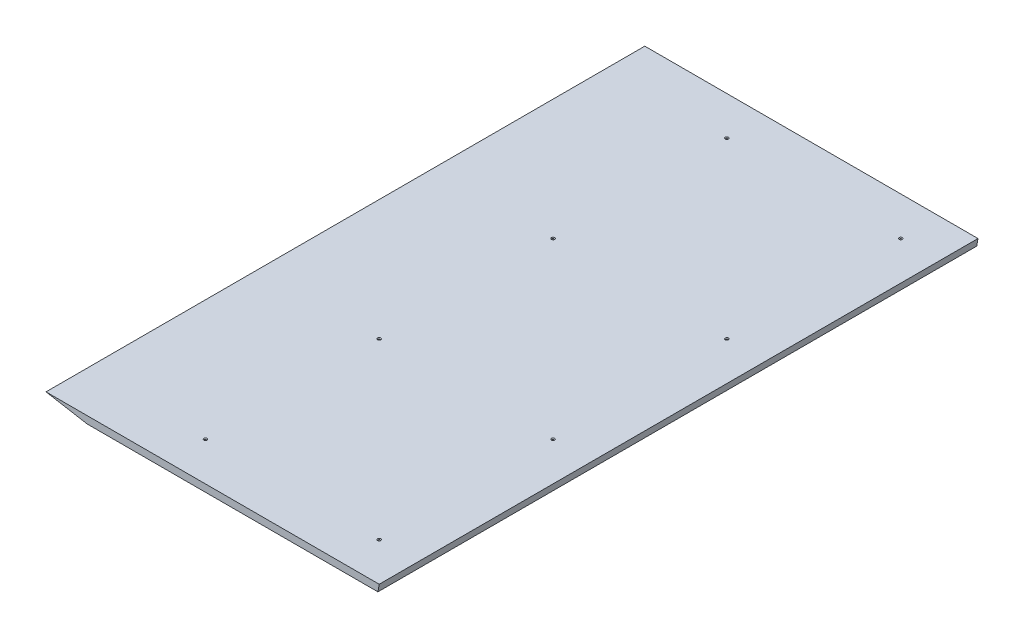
ISO-10303-21;
HEADER;
FILE_DESCRIPTION(('STEP AP214'),'2;1');
FILE_NAME('part.step','',(''),(''),'','','');
FILE_SCHEMA(('AUTOMOTIVE_DESIGN { 1 0 10303 214 1 1 1 1 }'));
ENDSEC;
DATA;
#1=APPLICATION_CONTEXT('core data for automotive mechanical design processes');
#2=APPLICATION_PROTOCOL_DEFINITION('international standard','automotive_design',2000,#1);
#3=PRODUCT_CONTEXT('',#1,'mechanical');
#4=PRODUCT('Part','Part','',(#3));
#5=PRODUCT_RELATED_PRODUCT_CATEGORY('part','',(#4));
#6=PRODUCT_DEFINITION_FORMATION('','',#4);
#7=PRODUCT_DEFINITION_CONTEXT('part definition',#1,'design');
#8=PRODUCT_DEFINITION('design','',#6,#7);
#9=PRODUCT_DEFINITION_SHAPE('','',#8);
#10=(LENGTH_UNIT() NAMED_UNIT(*) SI_UNIT(.MILLI.,.METRE.));
#11=(NAMED_UNIT(*) PLANE_ANGLE_UNIT() SI_UNIT($,.RADIAN.));
#12=(NAMED_UNIT(*) SI_UNIT($,.STERADIAN.) SOLID_ANGLE_UNIT());
#13=UNCERTAINTY_MEASURE_WITH_UNIT(LENGTH_MEASURE(1.E-05),#10,'distance_accuracy_value','');
#14=(GEOMETRIC_REPRESENTATION_CONTEXT(3) GLOBAL_UNCERTAINTY_ASSIGNED_CONTEXT((#13)) GLOBAL_UNIT_ASSIGNED_CONTEXT((#10,
#11,#12)) REPRESENTATION_CONTEXT('',''));
#15=CARTESIAN_POINT('',(0.,0.,0.));
#16=DIRECTION('',(0.,0.,1.));
#17=DIRECTION('',(1.,0.,0.));
#18=AXIS2_PLACEMENT_3D('',#15,#16,#17);
#19=CARTESIAN_POINT('',(0.,19.05,0.));
#20=DIRECTION('',(0.,0.,-1.));
#21=DIRECTION('',(-1.,0.,0.));
#22=AXIS2_PLACEMENT_3D('',#19,#20,#21);
#23=PLANE('',#22);
#24=DIRECTION('',(1.,0.,0.));
#25=VECTOR('',#24,1.);
#26=CARTESIAN_POINT('',(0.,19.05,0.));
#27=LINE('',#26,#25);
#28=CARTESIAN_POINT('',(0.,19.05,0.));
#29=VERTEX_POINT('',#28);
#30=CARTESIAN_POINT('',(876.3,19.05,0.));
#31=VERTEX_POINT('',#30);
#32=EDGE_CURVE('E87',#29,#31,#27,.T.);
#33=ORIENTED_EDGE('',*,*,#32,.F.);
#34=DIRECTION('',(-0.984807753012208,0.173648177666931,0.));
#35=VECTOR('',#34,1.);
#36=CARTESIAN_POINT('',(0.,19.05,0.));
#37=LINE('',#36,#35);
#38=CARTESIAN_POINT('',(108.037918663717,0.,0.));
#39=VERTEX_POINT('',#38);
#40=EDGE_CURVE('E76',#39,#29,#37,.T.);
#41=ORIENTED_EDGE('',*,*,#40,.F.);
#42=DIRECTION('',(1.,0.,0.));
#43=VECTOR('',#42,1.);
#44=CARTESIAN_POINT('',(0.,0.,0.));
#45=LINE('',#44,#43);
#46=CARTESIAN_POINT('',(872.940971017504,0.,0.));
#47=VERTEX_POINT('',#46);
#48=EDGE_CURVE('E82',#39,#47,#45,.T.);
#49=ORIENTED_EDGE('',*,*,#48,.T.);
#50=DIRECTION('',(-0.173648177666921,-0.98480775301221,0.));
#51=VECTOR('',#50,1.);
#52=CARTESIAN_POINT('',(872.940971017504,0.,0.));
#53=LINE('',#52,#51);
#54=EDGE_CURVE('E50',#31,#47,#53,.T.);
#55=ORIENTED_EDGE('',*,*,#54,.F.);
#56=EDGE_LOOP('',(#33,#41,#49,#55));
#57=FACE_BOUND('',#56,.T.);
#58=ADVANCED_FACE('F34',(#57),#23,.F.);
#59=CARTESIAN_POINT('',(0.,19.05,-1574.8));
#60=DIRECTION('',(0.,0.,1.));
#61=DIRECTION('',(1.,0.,0.));
#62=AXIS2_PLACEMENT_3D('',#59,#60,#61);
#63=PLANE('',#62);
#64=DIRECTION('',(-1.,0.,0.));
#65=VECTOR('',#64,1.);
#66=CARTESIAN_POINT('',(0.,0.,-1574.8));
#67=LINE('',#66,#65);
#68=CARTESIAN_POINT('',(872.940971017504,0.,-1574.8));
#69=VERTEX_POINT('',#68);
#70=CARTESIAN_POINT('',(108.037918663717,0.,-1574.8));
#71=VERTEX_POINT('',#70);
#72=EDGE_CURVE('E37',#69,#71,#67,.T.);
#73=ORIENTED_EDGE('',*,*,#72,.T.);
#74=DIRECTION('',(-0.984807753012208,0.173648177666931,0.));
#75=VECTOR('',#74,1.);
#76=CARTESIAN_POINT('',(0.,19.05,-1574.8));
#77=LINE('',#76,#75);
#78=CARTESIAN_POINT('',(0.,19.05,-1574.8));
#79=VERTEX_POINT('',#78);
#80=EDGE_CURVE('E58',#71,#79,#77,.T.);
#81=ORIENTED_EDGE('',*,*,#80,.T.);
#82=DIRECTION('',(-1.,0.,0.));
#83=VECTOR('',#82,1.);
#84=CARTESIAN_POINT('',(0.,19.05,-1574.8));
#85=LINE('',#84,#83);
#86=CARTESIAN_POINT('',(876.3,19.05,-1574.8));
#87=VERTEX_POINT('',#86);
#88=EDGE_CURVE('E11',#87,#79,#85,.T.);
#89=ORIENTED_EDGE('',*,*,#88,.F.);
#90=DIRECTION('',(-0.173648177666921,-0.98480775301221,0.));
#91=VECTOR('',#90,1.);
#92=CARTESIAN_POINT('',(872.940971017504,0.,-1574.8));
#93=LINE('',#92,#91);
#94=EDGE_CURVE('E99',#87,#69,#93,.T.);
#95=ORIENTED_EDGE('',*,*,#94,.T.);
#96=EDGE_LOOP('',(#73,#81,#89,#95));
#97=FACE_BOUND('',#96,.T.);
#98=ADVANCED_FACE('F182',(#97),#63,.F.);
#99=CARTESIAN_POINT('',(0.,19.05,0.));
#100=DIRECTION('',(0.,-1.,0.));
#101=DIRECTION('',(0.,0.,-1.));
#102=AXIS2_PLACEMENT_3D('',#99,#100,#101);
#103=PLANE('',#102);
#104=CARTESIAN_POINT('',(317.5,19.05,-1473.2));
#105=DIRECTION('',(0.,1.,0.));
#106=DIRECTION('',(0.,0.,1.));
#107=AXIS2_PLACEMENT_3D('',#104,#105,#106);
#108=CIRCLE('',#107,4.21640000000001);
#109=CARTESIAN_POINT('',(317.5,19.05,-1468.9836));
#110=VERTEX_POINT('',#109);
#111=EDGE_CURVE('E173',#110,#110,#108,.T.);
#112=ORIENTED_EDGE('',*,*,#111,.F.);
#113=EDGE_LOOP('',(#112));
#114=FACE_BOUND('',#113,.T.);
#115=CARTESIAN_POINT('',(774.7,19.05,-1473.2));
#116=DIRECTION('',(0.,1.,0.));
#117=DIRECTION('',(0.,0.,1.));
#118=AXIS2_PLACEMENT_3D('',#115,#116,#117);
#119=CIRCLE('',#118,4.21640000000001);
#120=CARTESIAN_POINT('',(774.7,19.05,-1468.9836));
#121=VERTEX_POINT('',#120);
#122=EDGE_CURVE('E164',#121,#121,#119,.T.);
#123=ORIENTED_EDGE('',*,*,#122,.F.);
#124=EDGE_LOOP('',(#123));
#125=FACE_BOUND('',#124,.T.);
#126=CARTESIAN_POINT('',(774.7,19.05,-1016.));
#127=DIRECTION('',(0.,1.,0.));
#128=DIRECTION('',(0.,0.,1.));
#129=AXIS2_PLACEMENT_3D('',#126,#127,#128);
#130=CIRCLE('',#129,4.21640000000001);
#131=CARTESIAN_POINT('',(774.7,19.05,-1011.7836));
#132=VERTEX_POINT('',#131);
#133=EDGE_CURVE('E155',#132,#132,#130,.T.);
#134=ORIENTED_EDGE('',*,*,#133,.F.);
#135=EDGE_LOOP('',(#134));
#136=FACE_BOUND('',#135,.T.);
#137=CARTESIAN_POINT('',(774.7,19.05,-558.8));
#138=DIRECTION('',(0.,1.,0.));
#139=DIRECTION('',(0.,0.,1.));
#140=AXIS2_PLACEMENT_3D('',#137,#138,#139);
#141=CIRCLE('',#140,4.21640000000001);
#142=CARTESIAN_POINT('',(774.7,19.05,-554.5836));
#143=VERTEX_POINT('',#142);
#144=EDGE_CURVE('E146',#143,#143,#141,.T.);
#145=ORIENTED_EDGE('',*,*,#144,.F.);
#146=EDGE_LOOP('',(#145));
#147=FACE_BOUND('',#146,.T.);
#148=CARTESIAN_POINT('',(774.7,19.05,-101.6));
#149=DIRECTION('',(0.,1.,0.));
#150=DIRECTION('',(0.,0.,1.));
#151=AXIS2_PLACEMENT_3D('',#148,#149,#150);
#152=CIRCLE('',#151,4.21640000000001);
#153=CARTESIAN_POINT('',(774.7,19.05,-97.3836000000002));
#154=VERTEX_POINT('',#153);
#155=EDGE_CURVE('E137',#154,#154,#152,.T.);
#156=ORIENTED_EDGE('',*,*,#155,.F.);
#157=EDGE_LOOP('',(#156));
#158=FACE_BOUND('',#157,.T.);
#159=CARTESIAN_POINT('',(317.5,19.05,-101.6));
#160=DIRECTION('',(0.,1.,0.));
#161=DIRECTION('',(0.,0.,1.));
#162=AXIS2_PLACEMENT_3D('',#159,#160,#161);
#163=CIRCLE('',#162,4.21640000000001);
#164=CARTESIAN_POINT('',(317.5,19.05,-97.3836000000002));
#165=VERTEX_POINT('',#164);
#166=EDGE_CURVE('E128',#165,#165,#163,.T.);
#167=ORIENTED_EDGE('',*,*,#166,.F.);
#168=EDGE_LOOP('',(#167));
#169=FACE_BOUND('',#168,.T.);
#170=CARTESIAN_POINT('',(317.5,19.05,-558.8));
#171=DIRECTION('',(0.,1.,0.));
#172=DIRECTION('',(0.,0.,1.));
#173=AXIS2_PLACEMENT_3D('',#170,#171,#172);
#174=CIRCLE('',#173,4.21640000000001);
#175=CARTESIAN_POINT('',(317.5,19.05,-554.5836));
#176=VERTEX_POINT('',#175);
#177=EDGE_CURVE('E119',#176,#176,#174,.T.);
#178=ORIENTED_EDGE('',*,*,#177,.F.);
#179=EDGE_LOOP('',(#178));
#180=FACE_BOUND('',#179,.T.);
#181=CARTESIAN_POINT('',(317.5,19.05,-1016.));
#182=DIRECTION('',(0.,1.,0.));
#183=DIRECTION('',(0.,0.,1.));
#184=AXIS2_PLACEMENT_3D('',#181,#182,#183);
#185=CIRCLE('',#184,4.21640000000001);
#186=CARTESIAN_POINT('',(317.5,19.05,-1011.7836));
#187=VERTEX_POINT('',#186);
#188=EDGE_CURVE('E110',#187,#187,#185,.T.);
#189=ORIENTED_EDGE('',*,*,#188,.F.);
#190=EDGE_LOOP('',(#189));
#191=FACE_BOUND('',#190,.T.);
#192=DIRECTION('',(0.,0.,1.));
#193=VECTOR('',#192,1.);
#194=CARTESIAN_POINT('',(0.,19.05,0.));
#195=LINE('',#194,#193);
#196=EDGE_CURVE('E92',#79,#29,#195,.T.);
#197=ORIENTED_EDGE('',*,*,#196,.T.);
#198=ORIENTED_EDGE('',*,*,#32,.T.);
#199=DIRECTION('',(0.,0.,-1.));
#200=VECTOR('',#199,1.);
#201=CARTESIAN_POINT('',(876.3,19.05,0.));
#202=LINE('',#201,#200);
#203=EDGE_CURVE('E42',#31,#87,#202,.T.);
#204=ORIENTED_EDGE('',*,*,#203,.T.);
#205=ORIENTED_EDGE('',*,*,#88,.T.);
#206=EDGE_LOOP('',(#197,#198,#204,#205));
#207=FACE_BOUND('',#206,.T.);
#208=ADVANCED_FACE('F179',(#114,#125,#136,#147,#158,#169,#180,#191,#207),#103,.F.);
#209=CARTESIAN_POINT('',(0.,0.,0.));
#210=DIRECTION('',(0.,-1.,0.));
#211=DIRECTION('',(0.,0.,-1.));
#212=AXIS2_PLACEMENT_3D('',#209,#210,#211);
#213=PLANE('',#212);
#214=CARTESIAN_POINT('',(317.5,0.,-1473.2));
#215=DIRECTION('',(0.,1.,0.));
#216=DIRECTION('',(0.,0.,1.));
#217=AXIS2_PLACEMENT_3D('',#214,#215,#216);
#218=CIRCLE('',#217,2.24789999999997);
#219=CARTESIAN_POINT('',(317.5,0.,-1470.9521));
#220=VERTEX_POINT('',#219);
#221=EDGE_CURVE('E167',#220,#220,#218,.T.);
#222=ORIENTED_EDGE('',*,*,#221,.T.);
#223=EDGE_LOOP('',(#222));
#224=FACE_BOUND('',#223,.T.);
#225=CARTESIAN_POINT('',(774.7,0.,-1473.2));
#226=DIRECTION('',(0.,1.,0.));
#227=DIRECTION('',(0.,0.,1.));
#228=AXIS2_PLACEMENT_3D('',#225,#226,#227);
#229=CIRCLE('',#228,2.24789999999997);
#230=CARTESIAN_POINT('',(774.7,0.,-1470.9521));
#231=VERTEX_POINT('',#230);
#232=EDGE_CURVE('E158',#231,#231,#229,.T.);
#233=ORIENTED_EDGE('',*,*,#232,.T.);
#234=EDGE_LOOP('',(#233));
#235=FACE_BOUND('',#234,.T.);
#236=CARTESIAN_POINT('',(774.7,0.,-1016.));
#237=DIRECTION('',(0.,1.,0.));
#238=DIRECTION('',(0.,0.,1.));
#239=AXIS2_PLACEMENT_3D('',#236,#237,#238);
#240=CIRCLE('',#239,2.24789999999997);
#241=CARTESIAN_POINT('',(774.7,0.,-1013.7521));
#242=VERTEX_POINT('',#241);
#243=EDGE_CURVE('E149',#242,#242,#240,.T.);
#244=ORIENTED_EDGE('',*,*,#243,.T.);
#245=EDGE_LOOP('',(#244));
#246=FACE_BOUND('',#245,.T.);
#247=CARTESIAN_POINT('',(774.7,0.,-558.8));
#248=DIRECTION('',(0.,1.,0.));
#249=DIRECTION('',(0.,0.,1.));
#250=AXIS2_PLACEMENT_3D('',#247,#248,#249);
#251=CIRCLE('',#250,2.24789999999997);
#252=CARTESIAN_POINT('',(774.7,0.,-556.5521));
#253=VERTEX_POINT('',#252);
#254=EDGE_CURVE('E140',#253,#253,#251,.T.);
#255=ORIENTED_EDGE('',*,*,#254,.T.);
#256=EDGE_LOOP('',(#255));
#257=FACE_BOUND('',#256,.T.);
#258=CARTESIAN_POINT('',(774.7,0.,-101.6));
#259=DIRECTION('',(0.,1.,0.));
#260=DIRECTION('',(0.,0.,1.));
#261=AXIS2_PLACEMENT_3D('',#258,#259,#260);
#262=CIRCLE('',#261,2.24789999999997);
#263=CARTESIAN_POINT('',(774.7,0.,-99.3521000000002));
#264=VERTEX_POINT('',#263);
#265=EDGE_CURVE('E131',#264,#264,#262,.T.);
#266=ORIENTED_EDGE('',*,*,#265,.T.);
#267=EDGE_LOOP('',(#266));
#268=FACE_BOUND('',#267,.T.);
#269=CARTESIAN_POINT('',(317.5,0.,-101.6));
#270=DIRECTION('',(0.,1.,0.));
#271=DIRECTION('',(0.,0.,1.));
#272=AXIS2_PLACEMENT_3D('',#269,#270,#271);
#273=CIRCLE('',#272,2.24789999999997);
#274=CARTESIAN_POINT('',(317.5,0.,-99.3521000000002));
#275=VERTEX_POINT('',#274);
#276=EDGE_CURVE('E122',#275,#275,#273,.T.);
#277=ORIENTED_EDGE('',*,*,#276,.T.);
#278=EDGE_LOOP('',(#277));
#279=FACE_BOUND('',#278,.T.);
#280=CARTESIAN_POINT('',(317.5,0.,-558.8));
#281=DIRECTION('',(0.,1.,0.));
#282=DIRECTION('',(0.,0.,1.));
#283=AXIS2_PLACEMENT_3D('',#280,#281,#282);
#284=CIRCLE('',#283,2.24789999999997);
#285=CARTESIAN_POINT('',(317.5,0.,-556.5521));
#286=VERTEX_POINT('',#285);
#287=EDGE_CURVE('E113',#286,#286,#284,.T.);
#288=ORIENTED_EDGE('',*,*,#287,.T.);
#289=EDGE_LOOP('',(#288));
#290=FACE_BOUND('',#289,.T.);
#291=CARTESIAN_POINT('',(317.5,0.,-1016.));
#292=DIRECTION('',(0.,1.,0.));
#293=DIRECTION('',(0.,0.,1.));
#294=AXIS2_PLACEMENT_3D('',#291,#292,#293);
#295=CIRCLE('',#294,2.24789999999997);
#296=CARTESIAN_POINT('',(317.5,0.,-1013.7521));
#297=VERTEX_POINT('',#296);
#298=EDGE_CURVE('E101',#297,#297,#295,.T.);
#299=ORIENTED_EDGE('',*,*,#298,.T.);
#300=EDGE_LOOP('',(#299));
#301=FACE_BOUND('',#300,.T.);
#302=DIRECTION('',(0.,0.,1.));
#303=VECTOR('',#302,1.);
#304=CARTESIAN_POINT('',(108.037918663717,0.,-1574.8));
#305=LINE('',#304,#303);
#306=EDGE_CURVE('E73',#71,#39,#305,.T.);
#307=ORIENTED_EDGE('',*,*,#306,.F.);
#308=ORIENTED_EDGE('',*,*,#72,.F.);
#309=DIRECTION('',(0.,0.,1.));
#310=VECTOR('',#309,1.);
#311=CARTESIAN_POINT('',(872.940971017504,0.,-1574.8));
#312=LINE('',#311,#310);
#313=EDGE_CURVE('E89',#69,#47,#312,.T.);
#314=ORIENTED_EDGE('',*,*,#313,.T.);
#315=ORIENTED_EDGE('',*,*,#48,.F.);
#316=EDGE_LOOP('',(#307,#308,#314,#315));
#317=FACE_BOUND('',#316,.T.);
#318=ADVANCED_FACE('F91',(#224,#235,#246,#257,#268,#279,#290,#301,#317),#213,.T.);
#319=CARTESIAN_POINT('',(872.940971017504,0.,-1574.8));
#320=DIRECTION('',(-0.98480775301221,0.173648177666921,0.));
#321=DIRECTION('',(-0.173648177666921,-0.98480775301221,0.));
#322=AXIS2_PLACEMENT_3D('',#319,#320,#321);
#323=PLANE('',#322);
#324=ORIENTED_EDGE('',*,*,#54,.T.);
#325=ORIENTED_EDGE('',*,*,#313,.F.);
#326=ORIENTED_EDGE('',*,*,#94,.F.);
#327=ORIENTED_EDGE('',*,*,#203,.F.);
#328=EDGE_LOOP('',(#324,#325,#326,#327));
#329=FACE_BOUND('',#328,.T.);
#330=ADVANCED_FACE('F200',(#329),#323,.F.);
#331=CARTESIAN_POINT('',(0.,19.05,-1574.8));
#332=DIRECTION('',(0.173648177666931,0.984807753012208,0.));
#333=DIRECTION('',(-0.984807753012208,0.173648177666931,0.));
#334=AXIS2_PLACEMENT_3D('',#331,#332,#333);
#335=PLANE('',#334);
#336=ORIENTED_EDGE('',*,*,#40,.T.);
#337=ORIENTED_EDGE('',*,*,#196,.F.);
#338=ORIENTED_EDGE('',*,*,#80,.F.);
#339=ORIENTED_EDGE('',*,*,#306,.T.);
#340=EDGE_LOOP('',(#336,#337,#338,#339));
#341=FACE_BOUND('',#340,.T.);
#342=ADVANCED_FACE('F75',(#341),#335,.F.);
#343=CARTESIAN_POINT('',(317.5,19.05,-1016.));
#344=DIRECTION('',(0.,1.,0.));
#345=DIRECTION('',(0.,0.,1.));
#346=AXIS2_PLACEMENT_3D('',#343,#344,#345);
#347=CYLINDRICAL_SURFACE('',#346,2.24789999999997);
#348=ORIENTED_EDGE('',*,*,#298,.F.);
#349=EDGE_LOOP('',(#348));
#350=FACE_BOUND('',#349,.T.);
#351=CARTESIAN_POINT('',(317.5,17.3982323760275,-1016.));
#352=DIRECTION('',(0.,1.,0.));
#353=DIRECTION('',(0.,0.,1.));
#354=AXIS2_PLACEMENT_3D('',#351,#352,#353);
#355=CIRCLE('',#354,2.24789999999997);
#356=CARTESIAN_POINT('',(317.5,17.3982323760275,-1013.7521));
#357=VERTEX_POINT('',#356);
#358=EDGE_CURVE('E107',#357,#357,#355,.T.);
#359=ORIENTED_EDGE('',*,*,#358,.T.);
#360=EDGE_LOOP('',(#359));
#361=FACE_BOUND('',#360,.T.);
#362=ADVANCED_FACE('F207',(#350,#361),#347,.F.);
#363=CARTESIAN_POINT('',(317.5,19.05,-1016.));
#364=DIRECTION('',(0.,1.,0.));
#365=DIRECTION('',(0.,0.,1.));
#366=AXIS2_PLACEMENT_3D('',#363,#364,#365);
#367=CONICAL_SURFACE('',#366,4.21640000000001,0.872664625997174);
#368=ORIENTED_EDGE('',*,*,#358,.F.);
#369=EDGE_LOOP('',(#368));
#370=FACE_BOUND('',#369,.T.);
#371=ORIENTED_EDGE('',*,*,#188,.T.);
#372=EDGE_LOOP('',(#371));
#373=FACE_BOUND('',#372,.T.);
#374=ADVANCED_FACE('F236',(#370,#373),#367,.F.);
#375=CARTESIAN_POINT('',(317.5,19.05,-558.8));
#376=DIRECTION('',(0.,1.,0.));
#377=DIRECTION('',(0.,0.,1.));
#378=AXIS2_PLACEMENT_3D('',#375,#376,#377);
#379=CYLINDRICAL_SURFACE('',#378,2.24789999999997);
#380=ORIENTED_EDGE('',*,*,#287,.F.);
#381=EDGE_LOOP('',(#380));
#382=FACE_BOUND('',#381,.T.);
#383=CARTESIAN_POINT('',(317.5,17.3982323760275,-558.8));
#384=DIRECTION('',(0.,1.,0.));
#385=DIRECTION('',(0.,0.,1.));
#386=AXIS2_PLACEMENT_3D('',#383,#384,#385);
#387=CIRCLE('',#386,2.24789999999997);
#388=CARTESIAN_POINT('',(317.5,17.3982323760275,-556.5521));
#389=VERTEX_POINT('',#388);
#390=EDGE_CURVE('E116',#389,#389,#387,.T.);
#391=ORIENTED_EDGE('',*,*,#390,.T.);
#392=EDGE_LOOP('',(#391));
#393=FACE_BOUND('',#392,.T.);
#394=ADVANCED_FACE('F247',(#382,#393),#379,.F.);
#395=CARTESIAN_POINT('',(317.5,19.05,-558.8));
#396=DIRECTION('',(0.,1.,0.));
#397=DIRECTION('',(0.,0.,1.));
#398=AXIS2_PLACEMENT_3D('',#395,#396,#397);
#399=CONICAL_SURFACE('',#398,4.21640000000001,0.872664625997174);
#400=ORIENTED_EDGE('',*,*,#390,.F.);
#401=EDGE_LOOP('',(#400));
#402=FACE_BOUND('',#401,.T.);
#403=ORIENTED_EDGE('',*,*,#177,.T.);
#404=EDGE_LOOP('',(#403));
#405=FACE_BOUND('',#404,.T.);
#406=ADVANCED_FACE('F257',(#402,#405),#399,.F.);
#407=CARTESIAN_POINT('',(317.5,19.05,-101.6));
#408=DIRECTION('',(0.,1.,0.));
#409=DIRECTION('',(0.,0.,1.));
#410=AXIS2_PLACEMENT_3D('',#407,#408,#409);
#411=CYLINDRICAL_SURFACE('',#410,2.24789999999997);
#412=ORIENTED_EDGE('',*,*,#276,.F.);
#413=EDGE_LOOP('',(#412));
#414=FACE_BOUND('',#413,.T.);
#415=CARTESIAN_POINT('',(317.5,17.3982323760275,-101.6));
#416=DIRECTION('',(0.,1.,0.));
#417=DIRECTION('',(0.,0.,1.));
#418=AXIS2_PLACEMENT_3D('',#415,#416,#417);
#419=CIRCLE('',#418,2.24789999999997);
#420=CARTESIAN_POINT('',(317.5,17.3982323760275,-99.3521000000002));
#421=VERTEX_POINT('',#420);
#422=EDGE_CURVE('E125',#421,#421,#419,.T.);
#423=ORIENTED_EDGE('',*,*,#422,.T.);
#424=EDGE_LOOP('',(#423));
#425=FACE_BOUND('',#424,.T.);
#426=ADVANCED_FACE('F267',(#414,#425),#411,.F.);
#427=CARTESIAN_POINT('',(317.5,19.05,-101.6));
#428=DIRECTION('',(0.,1.,0.));
#429=DIRECTION('',(0.,0.,1.));
#430=AXIS2_PLACEMENT_3D('',#427,#428,#429);
#431=CONICAL_SURFACE('',#430,4.21640000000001,0.872664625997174);
#432=ORIENTED_EDGE('',*,*,#422,.F.);
#433=EDGE_LOOP('',(#432));
#434=FACE_BOUND('',#433,.T.);
#435=ORIENTED_EDGE('',*,*,#166,.T.);
#436=EDGE_LOOP('',(#435));
#437=FACE_BOUND('',#436,.T.);
#438=ADVANCED_FACE('F277',(#434,#437),#431,.F.);
#439=CARTESIAN_POINT('',(774.7,19.05,-101.6));
#440=DIRECTION('',(0.,1.,0.));
#441=DIRECTION('',(0.,0.,1.));
#442=AXIS2_PLACEMENT_3D('',#439,#440,#441);
#443=CYLINDRICAL_SURFACE('',#442,2.24789999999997);
#444=ORIENTED_EDGE('',*,*,#265,.F.);
#445=EDGE_LOOP('',(#444));
#446=FACE_BOUND('',#445,.T.);
#447=CARTESIAN_POINT('',(774.7,17.3982323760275,-101.6));
#448=DIRECTION('',(0.,1.,0.));
#449=DIRECTION('',(0.,0.,1.));
#450=AXIS2_PLACEMENT_3D('',#447,#448,#449);
#451=CIRCLE('',#450,2.24789999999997);
#452=CARTESIAN_POINT('',(774.7,17.3982323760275,-99.3521000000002));
#453=VERTEX_POINT('',#452);
#454=EDGE_CURVE('E134',#453,#453,#451,.T.);
#455=ORIENTED_EDGE('',*,*,#454,.T.);
#456=EDGE_LOOP('',(#455));
#457=FACE_BOUND('',#456,.T.);
#458=ADVANCED_FACE('F287',(#446,#457),#443,.F.);
#459=CARTESIAN_POINT('',(774.7,19.05,-101.6));
#460=DIRECTION('',(0.,1.,0.));
#461=DIRECTION('',(0.,0.,1.));
#462=AXIS2_PLACEMENT_3D('',#459,#460,#461);
#463=CONICAL_SURFACE('',#462,4.21640000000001,0.872664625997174);
#464=ORIENTED_EDGE('',*,*,#454,.F.);
#465=EDGE_LOOP('',(#464));
#466=FACE_BOUND('',#465,.T.);
#467=ORIENTED_EDGE('',*,*,#155,.T.);
#468=EDGE_LOOP('',(#467));
#469=FACE_BOUND('',#468,.T.);
#470=ADVANCED_FACE('F297',(#466,#469),#463,.F.);
#471=CARTESIAN_POINT('',(774.7,19.05,-558.8));
#472=DIRECTION('',(0.,1.,0.));
#473=DIRECTION('',(0.,0.,1.));
#474=AXIS2_PLACEMENT_3D('',#471,#472,#473);
#475=CYLINDRICAL_SURFACE('',#474,2.24789999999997);
#476=ORIENTED_EDGE('',*,*,#254,.F.);
#477=EDGE_LOOP('',(#476));
#478=FACE_BOUND('',#477,.T.);
#479=CARTESIAN_POINT('',(774.7,17.3982323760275,-558.8));
#480=DIRECTION('',(0.,1.,0.));
#481=DIRECTION('',(0.,0.,1.));
#482=AXIS2_PLACEMENT_3D('',#479,#480,#481);
#483=CIRCLE('',#482,2.24789999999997);
#484=CARTESIAN_POINT('',(774.7,17.3982323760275,-556.5521));
#485=VERTEX_POINT('',#484);
#486=EDGE_CURVE('E143',#485,#485,#483,.T.);
#487=ORIENTED_EDGE('',*,*,#486,.T.);
#488=EDGE_LOOP('',(#487));
#489=FACE_BOUND('',#488,.T.);
#490=ADVANCED_FACE('F307',(#478,#489),#475,.F.);
#491=CARTESIAN_POINT('',(774.7,19.05,-558.8));
#492=DIRECTION('',(0.,1.,0.));
#493=DIRECTION('',(0.,0.,1.));
#494=AXIS2_PLACEMENT_3D('',#491,#492,#493);
#495=CONICAL_SURFACE('',#494,4.21640000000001,0.872664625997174);
#496=ORIENTED_EDGE('',*,*,#486,.F.);
#497=EDGE_LOOP('',(#496));
#498=FACE_BOUND('',#497,.T.);
#499=ORIENTED_EDGE('',*,*,#144,.T.);
#500=EDGE_LOOP('',(#499));
#501=FACE_BOUND('',#500,.T.);
#502=ADVANCED_FACE('F317',(#498,#501),#495,.F.);
#503=CARTESIAN_POINT('',(774.7,19.05,-1016.));
#504=DIRECTION('',(0.,1.,0.));
#505=DIRECTION('',(0.,0.,1.));
#506=AXIS2_PLACEMENT_3D('',#503,#504,#505);
#507=CYLINDRICAL_SURFACE('',#506,2.24789999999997);
#508=ORIENTED_EDGE('',*,*,#243,.F.);
#509=EDGE_LOOP('',(#508));
#510=FACE_BOUND('',#509,.T.);
#511=CARTESIAN_POINT('',(774.7,17.3982323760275,-1016.));
#512=DIRECTION('',(0.,1.,0.));
#513=DIRECTION('',(0.,0.,1.));
#514=AXIS2_PLACEMENT_3D('',#511,#512,#513);
#515=CIRCLE('',#514,2.24789999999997);
#516=CARTESIAN_POINT('',(774.7,17.3982323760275,-1013.7521));
#517=VERTEX_POINT('',#516);
#518=EDGE_CURVE('E152',#517,#517,#515,.T.);
#519=ORIENTED_EDGE('',*,*,#518,.T.);
#520=EDGE_LOOP('',(#519));
#521=FACE_BOUND('',#520,.T.);
#522=ADVANCED_FACE('F327',(#510,#521),#507,.F.);
#523=CARTESIAN_POINT('',(774.7,19.05,-1016.));
#524=DIRECTION('',(0.,1.,0.));
#525=DIRECTION('',(0.,0.,1.));
#526=AXIS2_PLACEMENT_3D('',#523,#524,#525);
#527=CONICAL_SURFACE('',#526,4.21640000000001,0.872664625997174);
#528=ORIENTED_EDGE('',*,*,#518,.F.);
#529=EDGE_LOOP('',(#528));
#530=FACE_BOUND('',#529,.T.);
#531=ORIENTED_EDGE('',*,*,#133,.T.);
#532=EDGE_LOOP('',(#531));
#533=FACE_BOUND('',#532,.T.);
#534=ADVANCED_FACE('F337',(#530,#533),#527,.F.);
#535=CARTESIAN_POINT('',(774.7,19.05,-1473.2));
#536=DIRECTION('',(0.,1.,0.));
#537=DIRECTION('',(0.,0.,1.));
#538=AXIS2_PLACEMENT_3D('',#535,#536,#537);
#539=CYLINDRICAL_SURFACE('',#538,2.24789999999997);
#540=ORIENTED_EDGE('',*,*,#232,.F.);
#541=EDGE_LOOP('',(#540));
#542=FACE_BOUND('',#541,.T.);
#543=CARTESIAN_POINT('',(774.7,17.3982323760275,-1473.2));
#544=DIRECTION('',(0.,1.,0.));
#545=DIRECTION('',(0.,0.,1.));
#546=AXIS2_PLACEMENT_3D('',#543,#544,#545);
#547=CIRCLE('',#546,2.24789999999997);
#548=CARTESIAN_POINT('',(774.7,17.3982323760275,-1470.9521));
#549=VERTEX_POINT('',#548);
#550=EDGE_CURVE('E161',#549,#549,#547,.T.);
#551=ORIENTED_EDGE('',*,*,#550,.T.);
#552=EDGE_LOOP('',(#551));
#553=FACE_BOUND('',#552,.T.);
#554=ADVANCED_FACE('F347',(#542,#553),#539,.F.);
#555=CARTESIAN_POINT('',(774.7,19.05,-1473.2));
#556=DIRECTION('',(0.,1.,0.));
#557=DIRECTION('',(0.,0.,1.));
#558=AXIS2_PLACEMENT_3D('',#555,#556,#557);
#559=CONICAL_SURFACE('',#558,4.21640000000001,0.872664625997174);
#560=ORIENTED_EDGE('',*,*,#550,.F.);
#561=EDGE_LOOP('',(#560));
#562=FACE_BOUND('',#561,.T.);
#563=ORIENTED_EDGE('',*,*,#122,.T.);
#564=EDGE_LOOP('',(#563));
#565=FACE_BOUND('',#564,.T.);
#566=ADVANCED_FACE('F357',(#562,#565),#559,.F.);
#567=CARTESIAN_POINT('',(317.5,19.05,-1473.2));
#568=DIRECTION('',(0.,1.,0.));
#569=DIRECTION('',(0.,0.,1.));
#570=AXIS2_PLACEMENT_3D('',#567,#568,#569);
#571=CYLINDRICAL_SURFACE('',#570,2.24789999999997);
#572=ORIENTED_EDGE('',*,*,#221,.F.);
#573=EDGE_LOOP('',(#572));
#574=FACE_BOUND('',#573,.T.);
#575=CARTESIAN_POINT('',(317.5,17.3982323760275,-1473.2));
#576=DIRECTION('',(0.,1.,0.));
#577=DIRECTION('',(0.,0.,1.));
#578=AXIS2_PLACEMENT_3D('',#575,#576,#577);
#579=CIRCLE('',#578,2.24789999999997);
#580=CARTESIAN_POINT('',(317.5,17.3982323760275,-1470.9521));
#581=VERTEX_POINT('',#580);
#582=EDGE_CURVE('E170',#581,#581,#579,.T.);
#583=ORIENTED_EDGE('',*,*,#582,.T.);
#584=EDGE_LOOP('',(#583));
#585=FACE_BOUND('',#584,.T.);
#586=ADVANCED_FACE('F367',(#574,#585),#571,.F.);
#587=CARTESIAN_POINT('',(317.5,19.05,-1473.2));
#588=DIRECTION('',(0.,1.,0.));
#589=DIRECTION('',(0.,0.,1.));
#590=AXIS2_PLACEMENT_3D('',#587,#588,#589);
#591=CONICAL_SURFACE('',#590,4.21640000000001,0.872664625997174);
#592=ORIENTED_EDGE('',*,*,#582,.F.);
#593=EDGE_LOOP('',(#592));
#594=FACE_BOUND('',#593,.T.);
#595=ORIENTED_EDGE('',*,*,#111,.T.);
#596=EDGE_LOOP('',(#595));
#597=FACE_BOUND('',#596,.T.);
#598=ADVANCED_FACE('F177',(#594,#597),#591,.F.);
#599=CLOSED_SHELL('',(#58,#98,#208,#318,#330,#342,#362,#374,#394,#406,#426,#438,#458,#470,#490,
#502,#522,#534,#554,#566,#586,#598));
#600=MANIFOLD_SOLID_BREP('B2',#599);
#601=ADVANCED_BREP_SHAPE_REPRESENTATION('',(#18,#600),#14);
#602=SHAPE_DEFINITION_REPRESENTATION(#9,#601);
ENDSEC;
END-ISO-10303-21;
